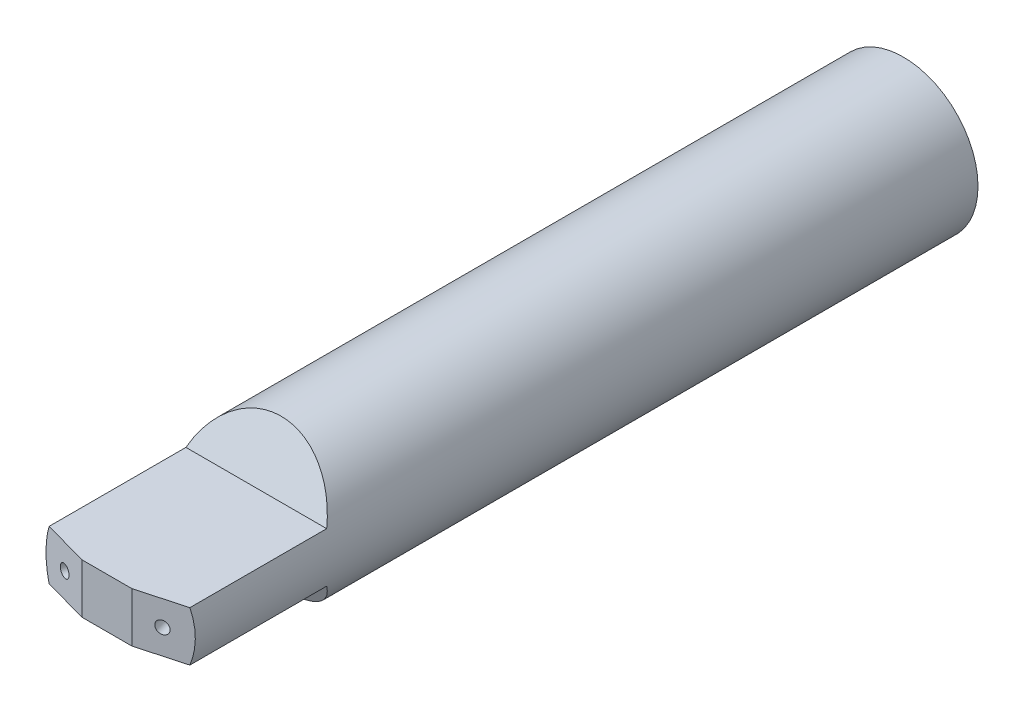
ISO-10303-21;
HEADER;
FILE_DESCRIPTION(('STEP AP214'),'2;1');
FILE_NAME('part.step','',(''),(''),'','','');
FILE_SCHEMA(('AUTOMOTIVE_DESIGN { 1 0 10303 214 1 1 1 1 }'));
ENDSEC;
DATA;
#1=APPLICATION_CONTEXT('core data for automotive mechanical design processes');
#2=APPLICATION_PROTOCOL_DEFINITION('international standard','automotive_design',2000,#1);
#3=PRODUCT_CONTEXT('',#1,'mechanical');
#4=PRODUCT('Part','Part','',(#3));
#5=PRODUCT_RELATED_PRODUCT_CATEGORY('part','',(#4));
#6=PRODUCT_DEFINITION_FORMATION('','',#4);
#7=PRODUCT_DEFINITION_CONTEXT('part definition',#1,'design');
#8=PRODUCT_DEFINITION('design','',#6,#7);
#9=PRODUCT_DEFINITION_SHAPE('','',#8);
#10=(LENGTH_UNIT() NAMED_UNIT(*) SI_UNIT(.MILLI.,.METRE.));
#11=(NAMED_UNIT(*) PLANE_ANGLE_UNIT() SI_UNIT($,.RADIAN.));
#12=(NAMED_UNIT(*) SI_UNIT($,.STERADIAN.) SOLID_ANGLE_UNIT());
#13=UNCERTAINTY_MEASURE_WITH_UNIT(LENGTH_MEASURE(1.E-05),#10,'distance_accuracy_value','');
#14=(GEOMETRIC_REPRESENTATION_CONTEXT(3) GLOBAL_UNCERTAINTY_ASSIGNED_CONTEXT((#13)) GLOBAL_UNIT_ASSIGNED_CONTEXT((#10,
#11,#12)) REPRESENTATION_CONTEXT('',''));
#15=CARTESIAN_POINT('',(0.,0.,0.));
#16=DIRECTION('',(0.,0.,1.));
#17=DIRECTION('',(1.,0.,0.));
#18=AXIS2_PLACEMENT_3D('',#15,#16,#17);
#19=CARTESIAN_POINT('',(0.,0.,32.));
#20=DIRECTION('',(0.,0.,-1.));
#21=DIRECTION('',(-1.,0.,0.));
#22=AXIS2_PLACEMENT_3D('',#19,#20,#21);
#23=CYLINDRICAL_SURFACE('',#22,3.);
#24=CARTESIAN_POINT('',(0.,0.,32.275));
#25=DIRECTION('',(-0.265156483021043,0.,-0.96420539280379));
#26=DIRECTION('',(0.96420539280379,0.,-0.265156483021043));
#27=AXIS2_PLACEMENT_3D('',#24,#25,#26);
#28=ELLIPSE('',#27,3.11137027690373,3.);
#29=CARTESIAN_POINT('',(2.82842712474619,0.999999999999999,31.4971825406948));
#30=VERTEX_POINT('',#29);
#31=CARTESIAN_POINT('',(2.82842712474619,-0.999999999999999,31.4971825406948));
#32=VERTEX_POINT('',#31);
#33=EDGE_CURVE('E129',#30,#32,#28,.T.);
#34=ORIENTED_EDGE('',*,*,#33,.T.);
#35=DIRECTION('',(0.,0.,-1.));
#36=VECTOR('',#35,1.);
#37=CARTESIAN_POINT('',(2.82842712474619,-0.999999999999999,32.));
#38=LINE('',#37,#36);
#39=CARTESIAN_POINT('',(2.82842712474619,-0.999999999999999,26.));
#40=VERTEX_POINT('',#39);
#41=EDGE_CURVE('E119',#32,#40,#38,.T.);
#42=ORIENTED_EDGE('',*,*,#41,.T.);
#43=CARTESIAN_POINT('',(0.,0.,26.5));
#44=DIRECTION('',(0.,0.447213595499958,-0.894427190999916));
#45=DIRECTION('',(0.,-0.894427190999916,-0.447213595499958));
#46=AXIS2_PLACEMENT_3D('',#43,#44,#45);
#47=ELLIPSE('',#46,3.35410196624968,3.);
#48=CARTESIAN_POINT('',(-2.82842712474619,-0.999999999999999,26.));
#49=VERTEX_POINT('',#48);
#50=EDGE_CURVE('E89',#40,#49,#47,.T.);
#51=ORIENTED_EDGE('',*,*,#50,.T.);
#52=DIRECTION('',(0.,0.,-1.));
#53=VECTOR('',#52,1.);
#54=CARTESIAN_POINT('',(-2.82842712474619,-0.999999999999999,32.));
#55=LINE('',#54,#53);
#56=CARTESIAN_POINT('',(-2.82842712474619,-0.999999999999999,31.4971825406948));
#57=VERTEX_POINT('',#56);
#58=EDGE_CURVE('E121',#49,#57,#55,.F.);
#59=ORIENTED_EDGE('',*,*,#58,.T.);
#60=CARTESIAN_POINT('',(0.,0.,32.275));
#61=DIRECTION('',(0.265156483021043,0.,-0.96420539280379));
#62=DIRECTION('',(-0.96420539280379,0.,-0.265156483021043));
#63=AXIS2_PLACEMENT_3D('',#60,#61,#62);
#64=ELLIPSE('',#63,3.11137027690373,3.);
#65=CARTESIAN_POINT('',(-2.82842712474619,0.999999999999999,31.4971825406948));
#66=VERTEX_POINT('',#65);
#67=EDGE_CURVE('E46',#57,#66,#64,.T.);
#68=ORIENTED_EDGE('',*,*,#67,.T.);
#69=DIRECTION('',(0.,0.,-1.));
#70=VECTOR('',#69,1.);
#71=CARTESIAN_POINT('',(-2.82842712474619,0.999999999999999,32.));
#72=LINE('',#71,#70);
#73=CARTESIAN_POINT('',(-2.82842712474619,0.999999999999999,26.));
#74=VERTEX_POINT('',#73);
#75=EDGE_CURVE('E111',#66,#74,#72,.T.);
#76=ORIENTED_EDGE('',*,*,#75,.T.);
#77=CARTESIAN_POINT('',(0.,0.,26.5));
#78=DIRECTION('',(0.,-0.447213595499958,-0.894427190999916));
#79=DIRECTION('',(0.,0.894427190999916,-0.447213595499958));
#80=AXIS2_PLACEMENT_3D('',#77,#78,#79);
#81=ELLIPSE('',#80,3.35410196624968,3.);
#82=CARTESIAN_POINT('',(2.82842712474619,0.999999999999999,26.));
#83=VERTEX_POINT('',#82);
#84=EDGE_CURVE('E101',#74,#83,#81,.T.);
#85=ORIENTED_EDGE('',*,*,#84,.T.);
#86=DIRECTION('',(0.,0.,-1.));
#87=VECTOR('',#86,1.);
#88=CARTESIAN_POINT('',(2.82842712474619,0.999999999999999,32.));
#89=LINE('',#88,#87);
#90=EDGE_CURVE('E113',#83,#30,#89,.F.);
#91=ORIENTED_EDGE('',*,*,#90,.T.);
#92=EDGE_LOOP('',(#34,#42,#51,#59,#68,#76,#85,#91));
#93=FACE_BOUND('',#92,.T.);
#94=CARTESIAN_POINT('',(0.,0.,0.));
#95=DIRECTION('',(0.,0.,1.));
#96=DIRECTION('',(1.,0.,0.));
#97=AXIS2_PLACEMENT_3D('',#94,#95,#96);
#98=CIRCLE('',#97,3.);
#99=CARTESIAN_POINT('',(3.,0.,0.));
#100=VERTEX_POINT('',#99);
#101=EDGE_CURVE('E108',#100,#100,#98,.T.);
#102=ORIENTED_EDGE('',*,*,#101,.T.);
#103=EDGE_LOOP('',(#102));
#104=FACE_BOUND('',#103,.T.);
#105=ADVANCED_FACE('F32',(#93,#104),#23,.T.);
#106=CARTESIAN_POINT('',(0.,0.,32.));
#107=DIRECTION('',(0.,0.,1.));
#108=DIRECTION('',(1.,0.,0.));
#109=AXIS2_PLACEMENT_3D('',#106,#107,#108);
#110=PLANE('',#109);
#111=DIRECTION('',(0.,1.,0.));
#112=VECTOR('',#111,1.);
#113=CARTESIAN_POINT('',(0.999999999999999,-3.,32.));
#114=LINE('',#113,#112);
#115=CARTESIAN_POINT('',(0.999999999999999,-0.999999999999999,32.));
#116=VERTEX_POINT('',#115);
#117=CARTESIAN_POINT('',(0.999999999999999,0.999999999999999,32.));
#118=VERTEX_POINT('',#117);
#119=EDGE_CURVE('E54',#116,#118,#114,.T.);
#120=ORIENTED_EDGE('',*,*,#119,.T.);
#121=DIRECTION('',(1.,0.,0.));
#122=VECTOR('',#121,1.);
#123=CARTESIAN_POINT('',(0.,0.999999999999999,32.));
#124=LINE('',#123,#122);
#125=CARTESIAN_POINT('',(-0.999999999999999,0.999999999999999,32.));
#126=VERTEX_POINT('',#125);
#127=EDGE_CURVE('E96',#126,#118,#124,.T.);
#128=ORIENTED_EDGE('',*,*,#127,.F.);
#129=DIRECTION('',(0.,1.,0.));
#130=VECTOR('',#129,1.);
#131=CARTESIAN_POINT('',(-0.999999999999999,-3.,32.));
#132=LINE('',#131,#130);
#133=CARTESIAN_POINT('',(-0.999999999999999,-0.999999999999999,32.));
#134=VERTEX_POINT('',#133);
#135=EDGE_CURVE('E83',#134,#126,#132,.T.);
#136=ORIENTED_EDGE('',*,*,#135,.F.);
#137=DIRECTION('',(-1.,0.,0.));
#138=VECTOR('',#137,1.);
#139=CARTESIAN_POINT('',(0.,-0.999999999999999,32.));
#140=LINE('',#139,#138);
#141=EDGE_CURVE('E94',#116,#134,#140,.T.);
#142=ORIENTED_EDGE('',*,*,#141,.F.);
#143=EDGE_LOOP('',(#120,#128,#136,#142));
#144=FACE_BOUND('',#143,.T.);
#145=ADVANCED_FACE('F93',(#144),#110,.T.);
#146=CARTESIAN_POINT('',(0.,0.,0.));
#147=DIRECTION('',(0.,0.,1.));
#148=DIRECTION('',(1.,0.,0.));
#149=AXIS2_PLACEMENT_3D('',#146,#147,#148);
#150=PLANE('',#149);
#151=ORIENTED_EDGE('',*,*,#101,.F.);
#152=EDGE_LOOP('',(#151));
#153=FACE_BOUND('',#152,.T.);
#154=ADVANCED_FACE('F167',(#153),#150,.F.);
#155=CARTESIAN_POINT('',(-3.,0.999999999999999,26.));
#156=DIRECTION('',(0.,-0.447213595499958,-0.894427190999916));
#157=DIRECTION('',(0.,0.894427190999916,-0.447213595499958));
#158=AXIS2_PLACEMENT_3D('',#155,#156,#157);
#159=PLANE('',#158);
#160=ORIENTED_EDGE('',*,*,#84,.F.);
#161=DIRECTION('',(1.,0.,0.));
#162=VECTOR('',#161,1.);
#163=CARTESIAN_POINT('',(-3.,0.999999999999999,26.));
#164=LINE('',#163,#162);
#165=EDGE_CURVE('E116',#74,#83,#164,.T.);
#166=ORIENTED_EDGE('',*,*,#165,.T.);
#167=EDGE_LOOP('',(#160,#166));
#168=FACE_BOUND('',#167,.T.);
#169=ADVANCED_FACE('F172',(#168),#159,.F.);
#170=CARTESIAN_POINT('',(-3.,0.999999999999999,32.));
#171=DIRECTION('',(0.,-1.,0.));
#172=DIRECTION('',(0.,0.,-1.));
#173=AXIS2_PLACEMENT_3D('',#170,#171,#172);
#174=PLANE('',#173);
#175=ORIENTED_EDGE('',*,*,#127,.T.);
#176=DIRECTION('',(0.96420539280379,0.,-0.265156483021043));
#177=VECTOR('',#176,1.);
#178=CARTESIAN_POINT('',(-2.71876815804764,0.999999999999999,33.0226612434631));
#179=LINE('',#178,#177);
#180=EDGE_CURVE('E126',#118,#30,#179,.T.);
#181=ORIENTED_EDGE('',*,*,#180,.T.);
#182=ORIENTED_EDGE('',*,*,#90,.F.);
#183=ORIENTED_EDGE('',*,*,#165,.F.);
#184=ORIENTED_EDGE('',*,*,#75,.F.);
#185=DIRECTION('',(0.96420539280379,0.,0.265156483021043));
#186=VECTOR('',#185,1.);
#187=CARTESIAN_POINT('',(-2.85938407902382,0.999999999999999,31.4886693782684));
#188=LINE('',#187,#186);
#189=EDGE_CURVE('E131',#66,#126,#188,.T.);
#190=ORIENTED_EDGE('',*,*,#189,.T.);
#191=EDGE_LOOP('',(#175,#181,#182,#183,#184,#190));
#192=FACE_BOUND('',#191,.T.);
#193=ADVANCED_FACE('F177',(#192),#174,.F.);
#194=CARTESIAN_POINT('',(-3.,-0.999999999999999,26.));
#195=DIRECTION('',(0.,0.447213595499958,-0.894427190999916));
#196=DIRECTION('',(0.,0.894427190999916,0.447213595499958));
#197=AXIS2_PLACEMENT_3D('',#194,#195,#196);
#198=PLANE('',#197);
#199=ORIENTED_EDGE('',*,*,#50,.F.);
#200=DIRECTION('',(1.,0.,0.));
#201=VECTOR('',#200,1.);
#202=CARTESIAN_POINT('',(-3.,-0.999999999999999,26.));
#203=LINE('',#202,#201);
#204=EDGE_CURVE('E123',#49,#40,#203,.T.);
#205=ORIENTED_EDGE('',*,*,#204,.F.);
#206=EDGE_LOOP('',(#199,#205));
#207=FACE_BOUND('',#206,.T.);
#208=ADVANCED_FACE('F182',(#207),#198,.F.);
#209=CARTESIAN_POINT('',(-3.,-0.999999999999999,32.));
#210=DIRECTION('',(0.,1.,0.));
#211=DIRECTION('',(0.,0.,1.));
#212=AXIS2_PLACEMENT_3D('',#209,#210,#211);
#213=PLANE('',#212);
#214=ORIENTED_EDGE('',*,*,#41,.F.);
#215=DIRECTION('',(-0.96420539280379,0.,0.265156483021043));
#216=VECTOR('',#215,1.);
#217=CARTESIAN_POINT('',(-2.71876815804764,-0.999999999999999,33.0226612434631));
#218=LINE('',#217,#216);
#219=EDGE_CURVE('E11',#32,#116,#218,.T.);
#220=ORIENTED_EDGE('',*,*,#219,.T.);
#221=ORIENTED_EDGE('',*,*,#141,.T.);
#222=DIRECTION('',(-0.96420539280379,0.,-0.265156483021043));
#223=VECTOR('',#222,1.);
#224=CARTESIAN_POINT('',(-2.85938407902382,-0.999999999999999,31.4886693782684));
#225=LINE('',#224,#223);
#226=EDGE_CURVE('E39',#134,#57,#225,.T.);
#227=ORIENTED_EDGE('',*,*,#226,.T.);
#228=ORIENTED_EDGE('',*,*,#58,.F.);
#229=ORIENTED_EDGE('',*,*,#204,.T.);
#230=EDGE_LOOP('',(#214,#220,#221,#227,#228,#229));
#231=FACE_BOUND('',#230,.T.);
#232=ADVANCED_FACE('F100',(#231),#213,.F.);
#233=CARTESIAN_POINT('',(-0.999999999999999,-3.,32.));
#234=DIRECTION('',(0.265156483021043,0.,-0.96420539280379));
#235=DIRECTION('',(-0.96420539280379,0.,-0.265156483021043));
#236=AXIS2_PLACEMENT_3D('',#233,#234,#235);
#237=PLANE('',#236);
#238=CARTESIAN_POINT('',(-1.96420539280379,0.,31.734843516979));
#239=DIRECTION('',(-0.265156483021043,0.,0.96420539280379));
#240=DIRECTION('',(0.96420539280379,0.,0.265156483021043));
#241=AXIS2_PLACEMENT_3D('',#238,#239,#240);
#242=CIRCLE('',#241,0.249999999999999);
#243=CARTESIAN_POINT('',(-1.72315404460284,0.,31.8011326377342));
#244=VERTEX_POINT('',#243);
#245=EDGE_CURVE('E137',#244,#244,#242,.T.);
#246=ORIENTED_EDGE('',*,*,#245,.F.);
#247=EDGE_LOOP('',(#246));
#248=FACE_BOUND('',#247,.T.);
#249=ORIENTED_EDGE('',*,*,#67,.F.);
#250=ORIENTED_EDGE('',*,*,#226,.F.);
#251=ORIENTED_EDGE('',*,*,#135,.T.);
#252=ORIENTED_EDGE('',*,*,#189,.F.);
#253=EDGE_LOOP('',(#249,#250,#251,#252));
#254=FACE_BOUND('',#253,.T.);
#255=ADVANCED_FACE('F82',(#248,#254),#237,.F.);
#256=CARTESIAN_POINT('',(0.999999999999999,-3.,32.));
#257=DIRECTION('',(-0.265156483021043,0.,-0.96420539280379));
#258=DIRECTION('',(-0.96420539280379,0.,0.265156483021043));
#259=AXIS2_PLACEMENT_3D('',#256,#257,#258);
#260=PLANE('',#259);
#261=CARTESIAN_POINT('',(1.96420539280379,0.,31.734843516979));
#262=DIRECTION('',(0.265156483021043,0.,0.96420539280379));
#263=DIRECTION('',(0.96420539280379,0.,-0.265156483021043));
#264=AXIS2_PLACEMENT_3D('',#261,#262,#263);
#265=CIRCLE('',#264,0.250000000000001);
#266=CARTESIAN_POINT('',(2.20525674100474,0.,31.6685543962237));
#267=VERTEX_POINT('',#266);
#268=EDGE_CURVE('E143',#267,#267,#265,.T.);
#269=ORIENTED_EDGE('',*,*,#268,.F.);
#270=EDGE_LOOP('',(#269));
#271=FACE_BOUND('',#270,.T.);
#272=ORIENTED_EDGE('',*,*,#119,.F.);
#273=ORIENTED_EDGE('',*,*,#219,.F.);
#274=ORIENTED_EDGE('',*,*,#33,.F.);
#275=ORIENTED_EDGE('',*,*,#180,.F.);
#276=EDGE_LOOP('',(#272,#273,#274,#275));
#277=FACE_BOUND('',#276,.T.);
#278=ADVANCED_FACE('F149',(#271,#277),#260,.F.);
#279=CARTESIAN_POINT('',(-0.638422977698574,0.,26.91381655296));
#280=DIRECTION('',(-0.265156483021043,0.,0.96420539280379));
#281=DIRECTION('',(0.96420539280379,0.,0.265156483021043));
#282=AXIS2_PLACEMENT_3D('',#279,#280,#281);
#283=CYLINDRICAL_SURFACE('',#282,0.249999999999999);
#284=CARTESIAN_POINT('',(-0.638422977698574,0.,26.91381655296));
#285=DIRECTION('',(-0.265156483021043,0.,0.96420539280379));
#286=DIRECTION('',(0.96420539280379,0.,0.265156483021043));
#287=AXIS2_PLACEMENT_3D('',#284,#285,#286);
#288=CIRCLE('',#287,0.249999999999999);
#289=CARTESIAN_POINT('',(-0.397371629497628,0.,26.9801056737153));
#290=VERTEX_POINT('',#289);
#291=EDGE_CURVE('E97',#290,#290,#288,.T.);
#292=ORIENTED_EDGE('',*,*,#291,.F.);
#293=EDGE_LOOP('',(#292));
#294=FACE_BOUND('',#293,.T.);
#295=ORIENTED_EDGE('',*,*,#245,.T.);
#296=EDGE_LOOP('',(#295));
#297=FACE_BOUND('',#296,.T.);
#298=ADVANCED_FACE('F151',(#294,#297),#283,.F.);
#299=CARTESIAN_POINT('',(-0.638422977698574,0.,26.91381655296));
#300=DIRECTION('',(-0.265156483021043,0.,0.96420539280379));
#301=DIRECTION('',(0.96420539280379,0.,0.265156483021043));
#302=AXIS2_PLACEMENT_3D('',#299,#300,#301);
#303=PLANE('',#302);
#304=ORIENTED_EDGE('',*,*,#291,.T.);
#305=EDGE_LOOP('',(#304));
#306=FACE_BOUND('',#305,.T.);
#307=ADVANCED_FACE('F157',(#306),#303,.T.);
#308=CARTESIAN_POINT('',(0.638422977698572,0.,26.91381655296));
#309=DIRECTION('',(0.265156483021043,0.,0.96420539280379));
#310=DIRECTION('',(0.96420539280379,0.,-0.265156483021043));
#311=AXIS2_PLACEMENT_3D('',#308,#309,#310);
#312=CYLINDRICAL_SURFACE('',#311,0.250000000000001);
#313=CARTESIAN_POINT('',(0.638422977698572,0.,26.91381655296));
#314=DIRECTION('',(0.265156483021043,0.,0.96420539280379));
#315=DIRECTION('',(0.96420539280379,0.,-0.265156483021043));
#316=AXIS2_PLACEMENT_3D('',#313,#314,#315);
#317=CIRCLE('',#316,0.250000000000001);
#318=CARTESIAN_POINT('',(0.879474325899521,0.,26.8475274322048));
#319=VERTEX_POINT('',#318);
#320=EDGE_CURVE('E140',#319,#319,#317,.T.);
#321=ORIENTED_EDGE('',*,*,#320,.F.);
#322=EDGE_LOOP('',(#321));
#323=FACE_BOUND('',#322,.T.);
#324=ORIENTED_EDGE('',*,*,#268,.T.);
#325=EDGE_LOOP('',(#324));
#326=FACE_BOUND('',#325,.T.);
#327=ADVANCED_FACE('F147',(#323,#326),#312,.F.);
#328=CARTESIAN_POINT('',(0.638422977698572,0.,26.91381655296));
#329=DIRECTION('',(0.265156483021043,0.,0.96420539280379));
#330=DIRECTION('',(0.96420539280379,0.,-0.265156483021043));
#331=AXIS2_PLACEMENT_3D('',#328,#329,#330);
#332=PLANE('',#331);
#333=ORIENTED_EDGE('',*,*,#320,.T.);
#334=EDGE_LOOP('',(#333));
#335=FACE_BOUND('',#334,.T.);
#336=ADVANCED_FACE('F226',(#335),#332,.T.);
#337=CLOSED_SHELL('',(#105,#145,#154,#169,#193,#208,#232,#255,#278,#298,#307,#327,#336));
#338=MANIFOLD_SOLID_BREP('B2',#337);
#339=ADVANCED_BREP_SHAPE_REPRESENTATION('',(#18,#338),#14);
#340=SHAPE_DEFINITION_REPRESENTATION(#9,#339);
ENDSEC;
END-ISO-10303-21;
